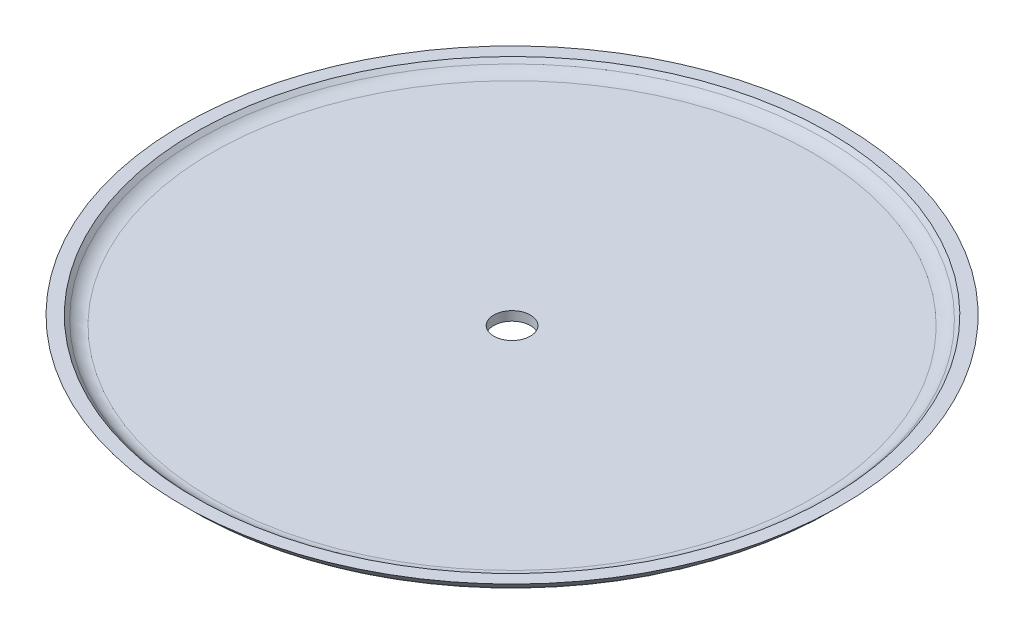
ISO-10303-21;
HEADER;
FILE_DESCRIPTION(('STEP AP214'),'2;1');
FILE_NAME('part.step','',(''),(''),'','','');
FILE_SCHEMA(('AUTOMOTIVE_DESIGN { 1 0 10303 214 1 1 1 1 }'));
ENDSEC;
DATA;
#1=APPLICATION_CONTEXT('core data for automotive mechanical design processes');
#2=APPLICATION_PROTOCOL_DEFINITION('international standard','automotive_design',2000,#1);
#3=PRODUCT_CONTEXT('',#1,'mechanical');
#4=PRODUCT('Part','Part','',(#3));
#5=PRODUCT_RELATED_PRODUCT_CATEGORY('part','',(#4));
#6=PRODUCT_DEFINITION_FORMATION('','',#4);
#7=PRODUCT_DEFINITION_CONTEXT('part definition',#1,'design');
#8=PRODUCT_DEFINITION('design','',#6,#7);
#9=PRODUCT_DEFINITION_SHAPE('','',#8);
#10=(LENGTH_UNIT() NAMED_UNIT(*) SI_UNIT(.MILLI.,.METRE.));
#11=(NAMED_UNIT(*) PLANE_ANGLE_UNIT() SI_UNIT($,.RADIAN.));
#12=(NAMED_UNIT(*) SI_UNIT($,.STERADIAN.) SOLID_ANGLE_UNIT());
#13=UNCERTAINTY_MEASURE_WITH_UNIT(LENGTH_MEASURE(1.E-05),#10,'distance_accuracy_value','');
#14=(GEOMETRIC_REPRESENTATION_CONTEXT(3) GLOBAL_UNCERTAINTY_ASSIGNED_CONTEXT((#13)) GLOBAL_UNIT_ASSIGNED_CONTEXT((#10,
#11,#12)) REPRESENTATION_CONTEXT('',''));
#15=CARTESIAN_POINT('',(0.,0.,0.));
#16=DIRECTION('',(0.,0.,1.));
#17=DIRECTION('',(1.,0.,0.));
#18=AXIS2_PLACEMENT_3D('',#15,#16,#17);
#19=CARTESIAN_POINT('',(-16.3786796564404,0.,0.));
#20=DIRECTION('',(0.,1.,0.));
#21=DIRECTION('',(0.,0.,1.));
#22=AXIS2_PLACEMENT_3D('',#19,#20,#21);
#23=PLANE('',#22);
#24=CARTESIAN_POINT('',(0.,0.,0.));
#25=DIRECTION('',(0.,1.,0.));
#26=DIRECTION('',(0.,0.,1.));
#27=AXIS2_PLACEMENT_3D('',#24,#25,#26);
#28=CIRCLE('',#27,1.);
#29=CARTESIAN_POINT('',(0.,0.,1.));
#30=VERTEX_POINT('',#29);
#31=EDGE_CURVE('E56',#30,#30,#28,.F.);
#32=ORIENTED_EDGE('',*,*,#31,.F.);
#33=EDGE_LOOP('',(#32));
#34=FACE_BOUND('',#33,.T.);
#35=CARTESIAN_POINT('',(0.,0.,0.));
#36=DIRECTION('',(0.,-1.,0.));
#37=DIRECTION('',(0.,0.,-1.));
#38=AXIS2_PLACEMENT_3D('',#35,#36,#37);
#39=CIRCLE('',#38,16.3786796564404);
#40=CARTESIAN_POINT('',(0.,0.,-16.3786796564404));
#41=VERTEX_POINT('',#40);
#42=EDGE_CURVE('E10',#41,#41,#39,.T.);
#43=ORIENTED_EDGE('',*,*,#42,.T.);
#44=EDGE_LOOP('',(#43));
#45=FACE_BOUND('',#44,.T.);
#46=ADVANCED_FACE('F31',(#34,#45),#23,.F.);
#47=CARTESIAN_POINT('',(0.,1.5,0.));
#48=DIRECTION('',(0.,-1.,0.));
#49=DIRECTION('',(0.,0.,-1.));
#50=AXIS2_PLACEMENT_3D('',#47,#48,#49);
#51=TOROIDAL_SURFACE('',#50,16.3786796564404,1.5);
#52=ORIENTED_EDGE('',*,*,#42,.F.);
#53=EDGE_LOOP('',(#52));
#54=FACE_BOUND('',#53,.T.);
#55=CARTESIAN_POINT('',(0.,0.439339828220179,0.));
#56=DIRECTION('',(0.,-1.,0.));
#57=DIRECTION('',(0.,0.,-1.));
#58=AXIS2_PLACEMENT_3D('',#55,#56,#57);
#59=CIRCLE('',#58,17.4393398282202);
#60=CARTESIAN_POINT('',(0.,0.439339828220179,-17.4393398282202));
#61=VERTEX_POINT('',#60);
#62=EDGE_CURVE('E37',#61,#61,#59,.T.);
#63=ORIENTED_EDGE('',*,*,#62,.T.);
#64=EDGE_LOOP('',(#63));
#65=FACE_BOUND('',#64,.T.);
#66=ADVANCED_FACE('F85',(#54,#65),#51,.T.);
#67=CARTESIAN_POINT('',(0.,1.00000000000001,0.));
#68=DIRECTION('',(0.,1.,0.));
#69=DIRECTION('',(0.,0.,1.));
#70=AXIS2_PLACEMENT_3D('',#67,#68,#69);
#71=CONICAL_SURFACE('',#70,18.,0.785398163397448);
#72=ORIENTED_EDGE('',*,*,#62,.F.);
#73=EDGE_LOOP('',(#72));
#74=FACE_BOUND('',#73,.T.);
#75=CARTESIAN_POINT('',(0.,1.00000000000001,0.));
#76=DIRECTION('',(0.,-1.,0.));
#77=DIRECTION('',(0.,0.,-1.));
#78=AXIS2_PLACEMENT_3D('',#75,#76,#77);
#79=CIRCLE('',#78,18.);
#80=CARTESIAN_POINT('',(0.,1.00000000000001,-18.));
#81=VERTEX_POINT('',#80);
#82=EDGE_CURVE('E41',#81,#81,#79,.T.);
#83=ORIENTED_EDGE('',*,*,#82,.T.);
#84=EDGE_LOOP('',(#83));
#85=FACE_BOUND('',#84,.T.);
#86=ADVANCED_FACE('F90',(#74,#85),#71,.T.);
#87=CARTESIAN_POINT('',(-17.2928932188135,1.00000000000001,0.));
#88=DIRECTION('',(0.,-1.,0.));
#89=DIRECTION('',(0.,0.,-1.));
#90=AXIS2_PLACEMENT_3D('',#87,#88,#89);
#91=PLANE('',#90);
#92=ORIENTED_EDGE('',*,*,#82,.F.);
#93=EDGE_LOOP('',(#92));
#94=FACE_BOUND('',#93,.T.);
#95=CARTESIAN_POINT('',(0.,1.00000000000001,0.));
#96=DIRECTION('',(0.,-1.,0.));
#97=DIRECTION('',(0.,0.,-1.));
#98=AXIS2_PLACEMENT_3D('',#95,#96,#97);
#99=CIRCLE('',#98,17.2928932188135);
#100=CARTESIAN_POINT('',(0.,1.00000000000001,-17.2928932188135));
#101=VERTEX_POINT('',#100);
#102=EDGE_CURVE('E45',#101,#101,#99,.T.);
#103=ORIENTED_EDGE('',*,*,#102,.T.);
#104=EDGE_LOOP('',(#103));
#105=FACE_BOUND('',#104,.T.);
#106=ADVANCED_FACE('F80',(#94,#105),#91,.F.);
#107=CARTESIAN_POINT('',(0.,0.792893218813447,0.));
#108=DIRECTION('',(0.,1.,0.));
#109=DIRECTION('',(0.,0.,1.));
#110=AXIS2_PLACEMENT_3D('',#107,#108,#109);
#111=CONICAL_SURFACE('',#110,17.0857864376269,0.78539816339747);
#112=ORIENTED_EDGE('',*,*,#102,.F.);
#113=EDGE_LOOP('',(#112));
#114=FACE_BOUND('',#113,.T.);
#115=CARTESIAN_POINT('',(0.,0.792893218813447,0.));
#116=DIRECTION('',(0.,-1.,0.));
#117=DIRECTION('',(0.,0.,-1.));
#118=AXIS2_PLACEMENT_3D('',#115,#116,#117);
#119=CIRCLE('',#118,17.0857864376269);
#120=CARTESIAN_POINT('',(0.,0.792893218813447,-17.0857864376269));
#121=VERTEX_POINT('',#120);
#122=EDGE_CURVE('E50',#121,#121,#119,.T.);
#123=ORIENTED_EDGE('',*,*,#122,.T.);
#124=EDGE_LOOP('',(#123));
#125=FACE_BOUND('',#124,.T.);
#126=ADVANCED_FACE('F74',(#114,#125),#111,.F.);
#127=CARTESIAN_POINT('',(0.,1.5,0.));
#128=DIRECTION('',(0.,-1.,0.));
#129=DIRECTION('',(0.,0.,-1.));
#130=AXIS2_PLACEMENT_3D('',#127,#128,#129);
#131=TOROIDAL_SURFACE('',#130,16.3786796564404,1.);
#132=ORIENTED_EDGE('',*,*,#122,.F.);
#133=EDGE_LOOP('',(#132));
#134=FACE_BOUND('',#133,.T.);
#135=CARTESIAN_POINT('',(0.,0.499999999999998,0.));
#136=DIRECTION('',(0.,-1.,0.));
#137=DIRECTION('',(0.,0.,-1.));
#138=AXIS2_PLACEMENT_3D('',#135,#136,#137);
#139=CIRCLE('',#138,16.3786796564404);
#140=CARTESIAN_POINT('',(0.,0.499999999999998,-16.3786796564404));
#141=VERTEX_POINT('',#140);
#142=EDGE_CURVE('E53',#141,#141,#139,.T.);
#143=ORIENTED_EDGE('',*,*,#142,.T.);
#144=EDGE_LOOP('',(#143));
#145=FACE_BOUND('',#144,.T.);
#146=ADVANCED_FACE('F69',(#134,#145),#131,.F.);
#147=CARTESIAN_POINT('',(0.,0.499999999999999,0.));
#148=DIRECTION('',(0.,-1.,0.));
#149=DIRECTION('',(0.,0.,-1.));
#150=AXIS2_PLACEMENT_3D('',#147,#148,#149);
#151=PLANE('',#150);
#152=CARTESIAN_POINT('',(0.,0.499999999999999,0.));
#153=DIRECTION('',(0.,1.,0.));
#154=DIRECTION('',(0.,0.,1.));
#155=AXIS2_PLACEMENT_3D('',#152,#153,#154);
#156=CIRCLE('',#155,1.);
#157=CARTESIAN_POINT('',(0.,0.499999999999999,1.));
#158=VERTEX_POINT('',#157);
#159=EDGE_CURVE('E59',#158,#158,#156,.T.);
#160=ORIENTED_EDGE('',*,*,#159,.F.);
#161=EDGE_LOOP('',(#160));
#162=FACE_BOUND('',#161,.T.);
#163=ORIENTED_EDGE('',*,*,#142,.F.);
#164=EDGE_LOOP('',(#163));
#165=FACE_BOUND('',#164,.T.);
#166=ADVANCED_FACE('F66',(#162,#165),#151,.F.);
#167=CARTESIAN_POINT('',(0.,-0.00099999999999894,0.));
#168=DIRECTION('',(0.,1.,0.));
#169=DIRECTION('',(0.,0.,1.));
#170=AXIS2_PLACEMENT_3D('',#167,#168,#169);
#171=CYLINDRICAL_SURFACE('',#170,1.);
#172=ORIENTED_EDGE('',*,*,#159,.T.);
#173=EDGE_LOOP('',(#172));
#174=FACE_BOUND('',#173,.T.);
#175=ORIENTED_EDGE('',*,*,#31,.T.);
#176=EDGE_LOOP('',(#175));
#177=FACE_BOUND('',#176,.T.);
#178=ADVANCED_FACE('F63',(#174,#177),#171,.F.);
#179=CLOSED_SHELL('',(#46,#66,#86,#106,#126,#146,#166,#178));
#180=MANIFOLD_SOLID_BREP('B2',#179);
#181=ADVANCED_BREP_SHAPE_REPRESENTATION('',(#18,#180),#14);
#182=SHAPE_DEFINITION_REPRESENTATION(#9,#181);
ENDSEC;
END-ISO-10303-21;
